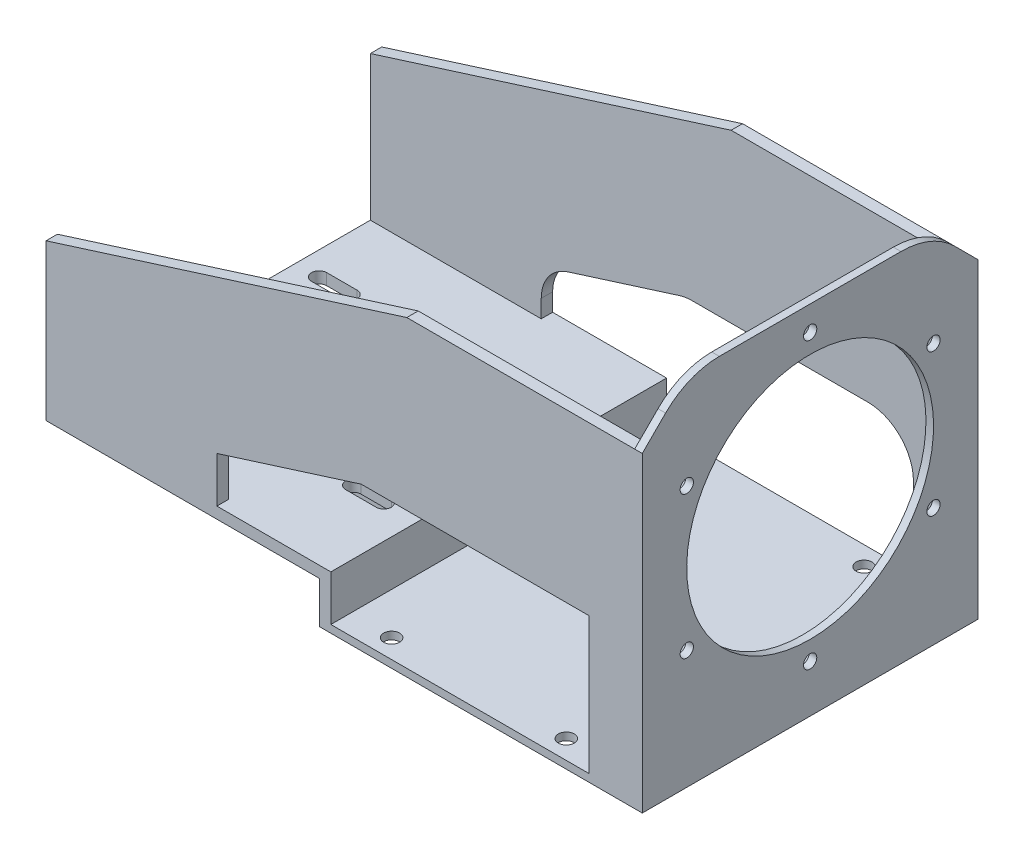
from build123d import *

# Parameters (mm, degrees)
BOSS_EXTRUDE1_DEPTH  = 221
SKETCH2_R            = 162.5
CUT_EXTRUDE2_DEPTH   = 10
BOSS_EXTRUDE3_START  = -10
BOSS_EXTRUDE3_DEPTH  = 10
BOSS_EXTRUDE4_DEPTH  = 15
BOSS_EXTRUDE5_DEPTH  = 412
CUT_EXTRUDE7_DEPTH   = 1017.114658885
SKETCH9_R            = 8.75
CUT_EXTRUDE5_DEPTH   = 20
SKETCH7_W            = 360
SKETCH7_H            = 55
CUT_EXTRUDE3_DEPTH   = 1017.114658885
CIRPATTERN1_COUNT    = 6
CUT_EXTRUDE6_DEPTH   = 909.331437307
LPATTERN1_COUNT      = 2
LPATTERN1_PITCH      = 260
LPATTERN1_COUNT_DIR2 = 2
LPATTERN1_PITCH_DIR2 = 215
FILLET1_R            = 100
FILLET4_R            = 60
SKETCH15_R           = 10.5
CUT_EXTRUDE8_DEPTH   = 937.30443767
FILLET6_R            = 50
SKETCH16_W           = 360
SKETCH16_H           = 55
BOSS_EXTRUDE6_DEPTH  = 15


with BuildPart() as part:
    # Sketch1 → Boss-Extrude1 (new, symmetric)
    with BuildSketch(Plane.XY):
        Polygon((0, 250), (0, 0), (-785, 0), (-785, 10), (-10, 10), (-10, 250), align=None)
    extrude(amount=BOSS_EXTRUDE1_DEPTH, both=True)

    # Sketch2 → Cut-Extrude2 (cut)
    with BuildSketch(Plane.ZY.offset(10)):
        with Locations((0, 250)):
            Circle(SKETCH2_R)
    extrude(amount=-CUT_EXTRUDE2_DEPTH, mode=Mode.SUBTRACT)

    # Sketch4 → Boss-Extrude3 (add)
    with BuildSketch(Plane(origin=(0, 0, 0), x_dir=(0, 0, -1), z_dir=(1, 0, 0)).offset(BOSS_EXTRUDE3_START)):
        with BuildLine():
            Line((162.5, 250), (221, 250))
            Line((221, 250), (221, 410))
            Line((221, 410), (161, 470))
            Line((161, 470), (-161, 470))
            Line((-161, 470), (-221, 410))
            Line((-221, 410), (-221, 250))
            Line((-221, 250), (-162.5, 250))
            ThreePointArc((-162.5, 250), (0, 412.5), (162.5, 250))
        make_face()
    extrude(amount=BOSS_EXTRUDE3_DEPTH)

    # Sketch3 → Boss-Extrude4 (add)
    with BuildSketch(Plane(origin=(0, 0, -221), x_dir=(-1, 0, 0), z_dir=(0, 0, -1))):
        Polygon((10, 410), (310, 410), (785, 260), (785, 10), (10, 10), align=None)
    boss_extrude4 = extrude(amount=-BOSS_EXTRUDE4_DEPTH)

    # Mirror2: Boss-Extrude4 across plane
    add(boss_extrude4.mirror(Plane.XY))

    # Sketch6 → Boss-Extrude5 (add)
    with BuildSketch(Plane.XY.offset(-206)):
        Polygon((-410, 70), (-410, 10), (-425, 10), (-425, 55), (-785, 55), (-785, 70), align=None)
    extrude(amount=BOSS_EXTRUDE5_DEPTH)

    # Sketch14 → Cut-Extrude7 (cut, through all)
    with BuildSketch(Plane(origin=(0, 0, -221), x_dir=(-1, 0, 0), z_dir=(0, 0, -1))):
        Polygon((560, 70), (410, 70), (410, 10), (70, 10), (70, 190), (370, 190), (560, 130), align=None)
    extrude(amount=-CUT_EXTRUDE7_DEPTH, mode=Mode.SUBTRACT)

    # Sketch9 → Cut-Extrude5 (cut)
    with BuildSketch(Plane.ZY.offset(10)):
        with Locations(Location((0, 437.5, 0), (0, 0, 270))):
            Circle(SKETCH9_R)
    cut_extrude5 = extrude(amount=-CUT_EXTRUDE5_DEPTH, mode=Mode.SUBTRACT)

    # Sketch7 → Cut-Extrude3 (cut, through all)
    with BuildSketch(Plane(origin=(0, 0, -221), x_dir=(-1, 0, 0), z_dir=(0, 0, -1))):
        with Locations((605, 27.5)):
            Rectangle(SKETCH7_W, SKETCH7_H)
    extrude(amount=-CUT_EXTRUDE3_DEPTH, mode=Mode.SUBTRACT)

    # CirPattern1: Cut-Extrude5 ×6 about axis
    cirpattern1_axis = Axis((0, 250, 0), (1, 0, 0))
    for i in range(1, CIRPATTERN1_COUNT):
        add(cut_extrude5.rotate(cirpattern1_axis, i * 360 / CIRPATTERN1_COUNT), mode=Mode.SUBTRACT)

    # Sketch13 → Cut-Extrude6 (cut, through all)
    with BuildSketch(Plane(origin=(0, 70, 0), x_dir=(1, 0, 0), z_dir=(0, 1, 0))):
        with BuildLine():
            Line((-453.9, 97.5), (-493.9, 97.5))
            ThreePointArc((-493.9, 97.5), (-503.9, 107.5), (-493.9, 117.5))
            Line((-493.9, 117.5), (-453.9, 117.5))
            ThreePointArc((-453.9, 117.5), (-443.9, 107.5), (-453.9, 97.5))
        make_face()
    cut_extrude6 = extrude(amount=-CUT_EXTRUDE6_DEPTH, mode=Mode.SUBTRACT)

    # LPattern1: Cut-Extrude6 2 × 2
    with Locations(*[(-i * LPATTERN1_PITCH, 0, j * LPATTERN1_PITCH_DIR2) for i in range(LPATTERN1_COUNT) for j in range(LPATTERN1_COUNT_DIR2) if (i, j) != (0, 0)]):
        add(cut_extrude6, mode=Mode.SUBTRACT)

    # Fillet1
    fillet1_edges = [part.edges().sort_by_distance(p)[0] for p in [
        (-5, 470, 161),
        (-5, 470, -161),
    ]]
    fillet(fillet1_edges, radius=FILLET1_R)

    # Fillet4
    fillet4_edges = [part.edges().sort_by_distance(p)[0] for p in [
        (-70, 190, -213.5),
    ]]
    fillet(fillet4_edges, radius=FILLET4_R)

    # Sketch15 → Cut-Extrude8 (cut, through all)
    with BuildSketch(Plane(origin=(0, 10, 0), x_dir=(1, 0, 0), z_dir=(0, 1, 0))):
        with Locations(Location((-125, 196, 0), (0, 0, 180))):
            Circle(SKETCH15_R)
        with Locations(Location((-355, 196, 0), (0, 0, 180))):
            Circle(SKETCH15_R)
    cut_extrude8 = extrude(amount=-CUT_EXTRUDE8_DEPTH, mode=Mode.SUBTRACT)

    # Mirror5: Cut-Extrude8 across plane
    add(cut_extrude8.mirror(Plane.XY), mode=Mode.SUBTRACT)

    # Fillet6
    fillet6_edges = [part.edges().sort_by_distance(p)[0] for p in [
        (-370, 190, -213.5),
        (-560, 130, -213.5),
    ]]
    fillet(fillet6_edges, radius=FILLET6_R)

    # Sketch16 → Boss-Extrude6 (add)
    with BuildSketch(Plane.XY.offset(70)):
        with Locations((-605, 27.5)):
            Rectangle(SKETCH16_W, SKETCH16_H)
    boss_extrude6 = extrude(amount=-BOSS_EXTRUDE6_DEPTH)

    # Mirror6: Boss-Extrude6 across plane
    add(boss_extrude6.mirror(Plane.XY))


solid = part.part
